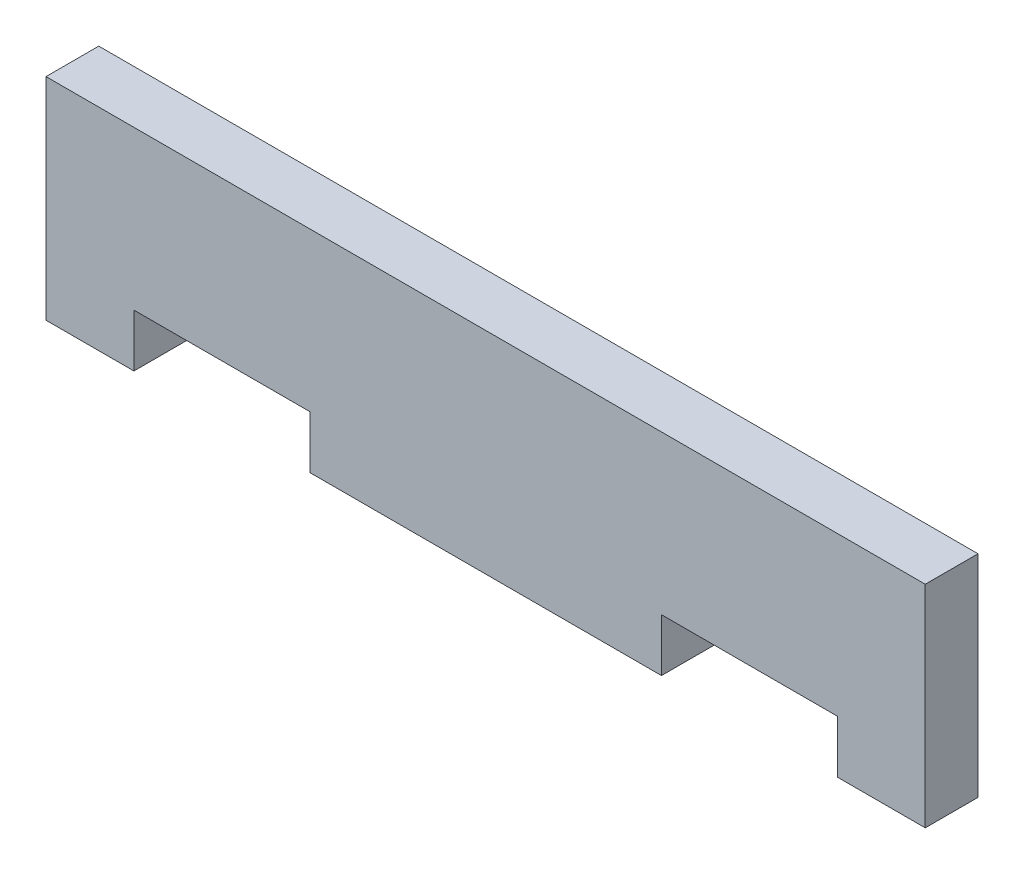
from build123d import *

# Parameters (mm, degrees)
ESQUISSE1_W             = 50
ESQUISSE1_H             = 12
BOSS_EXTRU_1_DEPTH      = 3
ESQUISSE2_W             = 10
ESQUISSE2_H             = 3
ENL_V_MAT_EXTRU_1_DEPTH = 52.507281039


with BuildPart() as part:
    # Esquisse1 → Boss.-Extru.1 (new body)
    with BuildSketch(Plane.XY):
        with Locations((25, 6)):
            Rectangle(ESQUISSE1_W, ESQUISSE1_H)
    extrude(amount=BOSS_EXTRU_1_DEPTH)

    # Esquisse2 → Enl_v. mat.-Extru.1 (cut, through all)
    with BuildSketch(Plane.XY.offset(3)):
        with Locations((10, 1.5)):
            Rectangle(ESQUISSE2_W, ESQUISSE2_H)
    enl_v_mat_extru_1 = extrude(amount=-ENL_V_MAT_EXTRU_1_DEPTH, mode=Mode.SUBTRACT)

    # Sym_trie1: Enl_v. mat.-Extru.1 across plane
    add(enl_v_mat_extru_1.mirror(Plane(origin=(25, 0, 0), x_dir=(0, 0, 1), z_dir=(1, 0, 0))), mode=Mode.SUBTRACT)


solid = part.part
